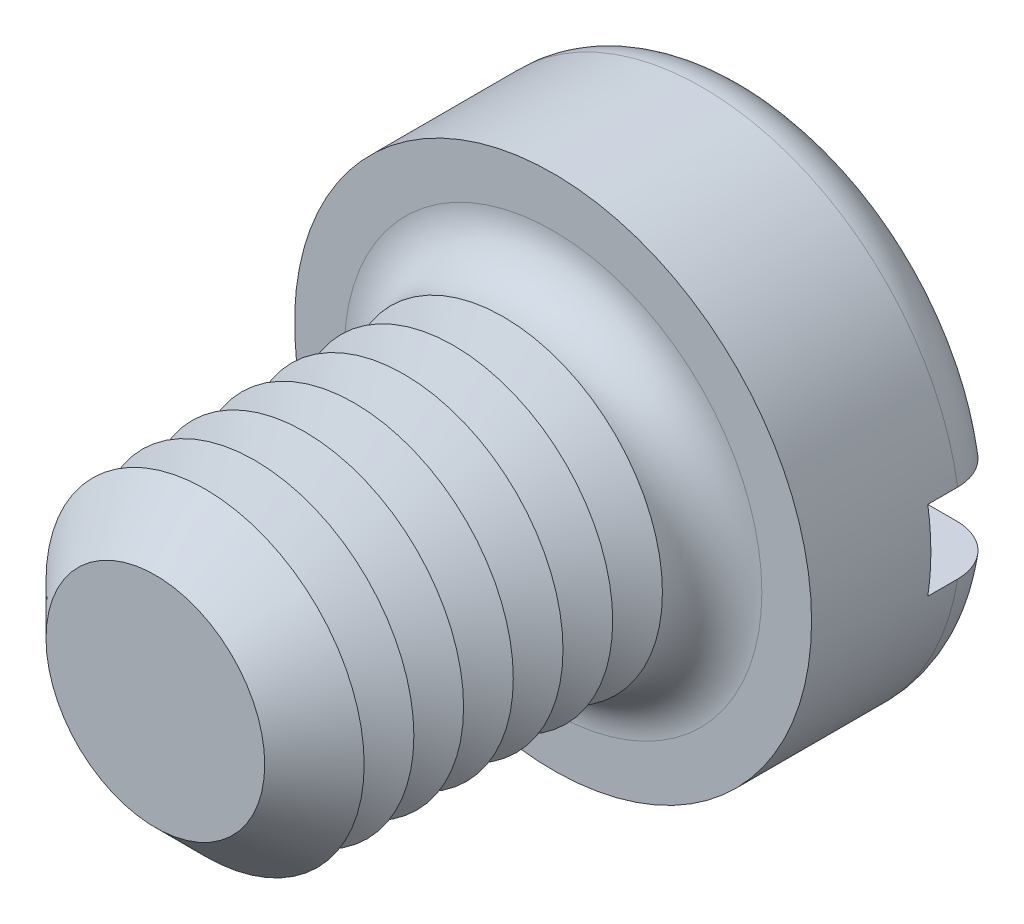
from build123d import *

# Parameters (mm, degrees)
SKETCH3_R           = 6.5
BOSS_EXTRUDE2_DEPTH = 5
SKETCH4_R           = 4
BOSS_EXTRUDE3_DEPTH = 10
FILLET1_R           = 1.25
CHAMFER1_SIZE       = 1.25
LPATTERN1_COUNT     = 6
LPATTERN1_PITCH     = 1.25
SKETCH8_W           = 13
SKETCH8_H           = 2
CUT_EXTRUDE1_DEPTH  = 2


with BuildPart() as part:
    # Sketch3 → Boss-Extrude2 (new body)
    with BuildSketch(Plane.XY):
        Circle(SKETCH3_R)
    extrude(amount=-BOSS_EXTRUDE2_DEPTH)

    # Sketch4 → Boss-Extrude3 (add)
    with BuildSketch(Plane.XY):
        Circle(SKETCH4_R)
    extrude(amount=BOSS_EXTRUDE3_DEPTH)

    # Fillet1
    fillet1_edges = [part.edges().sort_by_distance(p)[0] for p in [
        (-6.5, 0, -5),
        (-4, 0, 0),
    ]]
    fillet(fillet1_edges, radius=FILLET1_R)

    # Chamfer1
    chamfer1_edges = [part.edges().sort_by_distance(p)[0] for p in [
        (-4, 0, 10),
    ]]
    chamfer(chamfer1_edges, length=CHAMFER1_SIZE)

    # Sketch6 → Cut-Revolve1 (revolve, cut)
    with BuildSketch(Plane(origin=(0, 0, 0), x_dir=(0, 0, -1), z_dir=(1, 0, 0)), mode=Mode.PRIVATE) as cut_revolve1_sk:
        Polygon((-1.25, 4), (-1.875, 2.917468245), (-2.5, 4), align=None)
    cut_revolve1 = revolve(cut_revolve1_sk.sketch.rotate(Axis((0, 0, -1.694361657), (0, 0, 1)), 90), axis=Axis((0, 0, -1.694361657), (0, 0, 1)), mode=Mode.SUBTRACT)

    # LPattern1: Cut-Revolve1 ×6
    with Locations(*[(0, 0, i * LPATTERN1_PITCH) for i in range(1, LPATTERN1_COUNT)]):
        add(cut_revolve1, mode=Mode.SUBTRACT)

    # Sketch8 → Cut-Extrude1 (cut)
    with BuildSketch(Plane(origin=(0, 0, -5), x_dir=(-1, 0, 0), z_dir=(0, 0, -1))):
        Rectangle(SKETCH8_W, SKETCH8_H)
    extrude(amount=-CUT_EXTRUDE1_DEPTH, mode=Mode.SUBTRACT)


solid = part.part
